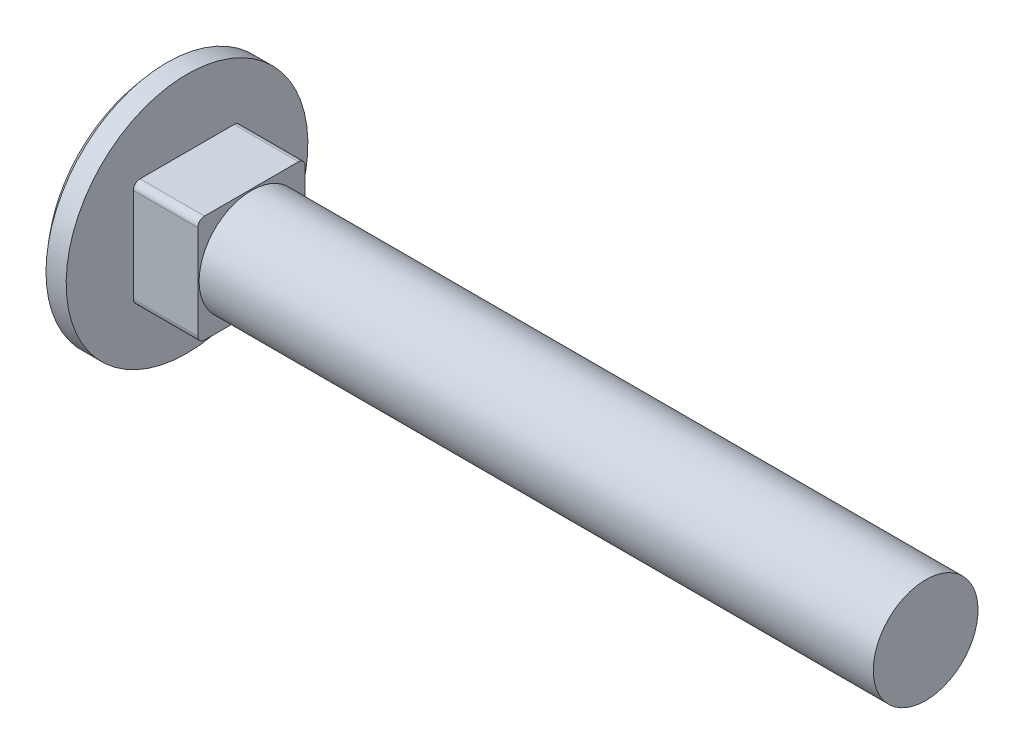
ISO-10303-21;
HEADER;
FILE_DESCRIPTION(('STEP AP214'),'2;1');
FILE_NAME('part.step','',(''),(''),'','','');
FILE_SCHEMA(('AUTOMOTIVE_DESIGN { 1 0 10303 214 1 1 1 1 }'));
ENDSEC;
DATA;
#1=APPLICATION_CONTEXT('core data for automotive mechanical design processes');
#2=APPLICATION_PROTOCOL_DEFINITION('international standard','automotive_design',2000,#1);
#3=PRODUCT_CONTEXT('',#1,'mechanical');
#4=PRODUCT('Part','Part','',(#3));
#5=PRODUCT_RELATED_PRODUCT_CATEGORY('part','',(#4));
#6=PRODUCT_DEFINITION_FORMATION('','',#4);
#7=PRODUCT_DEFINITION_CONTEXT('part definition',#1,'design');
#8=PRODUCT_DEFINITION('design','',#6,#7);
#9=PRODUCT_DEFINITION_SHAPE('','',#8);
#10=(LENGTH_UNIT() NAMED_UNIT(*) SI_UNIT(.MILLI.,.METRE.));
#11=(NAMED_UNIT(*) PLANE_ANGLE_UNIT() SI_UNIT($,.RADIAN.));
#12=(NAMED_UNIT(*) SI_UNIT($,.STERADIAN.) SOLID_ANGLE_UNIT());
#13=UNCERTAINTY_MEASURE_WITH_UNIT(LENGTH_MEASURE(1.E-05),#10,'distance_accuracy_value','');
#14=(GEOMETRIC_REPRESENTATION_CONTEXT(3) GLOBAL_UNCERTAINTY_ASSIGNED_CONTEXT((#13)) GLOBAL_UNIT_ASSIGNED_CONTEXT((#10,
#11,#12)) REPRESENTATION_CONTEXT('',''));
#15=CARTESIAN_POINT('',(0.,0.,0.));
#16=DIRECTION('',(0.,0.,1.));
#17=DIRECTION('',(1.,0.,0.));
#18=AXIS2_PLACEMENT_3D('',#15,#16,#17);
#19=CARTESIAN_POINT('',(779.702466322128,1095.70735678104,0.));
#20=DIRECTION('',(-1.,0.,0.));
#21=DIRECTION('',(0.,-1.,0.));
#22=AXIS2_PLACEMENT_3D('',#19,#20,#21);
#23=PLANE('',#22);
#24=CARTESIAN_POINT('',(779.702466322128,1091.80735678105,0.));
#25=DIRECTION('',(-1.,0.,0.));
#26=DIRECTION('',(0.,-1.,0.));
#27=AXIS2_PLACEMENT_3D('',#24,#25,#26);
#28=CIRCLE('',#27,9.00000000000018);
#29=CARTESIAN_POINT('',(779.702466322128,1082.80735678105,0.));
#30=VERTEX_POINT('',#29);
#31=EDGE_CURVE('E25',#30,#30,#28,.T.);
#32=ORIENTED_EDGE('',*,*,#31,.F.);
#33=EDGE_LOOP('',(#32));
#34=FACE_BOUND('',#33,.T.);
#35=CARTESIAN_POINT('',(779.702466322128,1095.30735678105,-3.5));
#36=DIRECTION('',(1.,0.,0.));
#37=DIRECTION('',(0.,1.,0.));
#38=AXIS2_PLACEMENT_3D('',#35,#36,#37);
#39=CIRCLE('',#38,0.499999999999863);
#40=CARTESIAN_POINT('',(779.702466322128,1095.30735678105,-4.));
#41=VERTEX_POINT('',#40);
#42=CARTESIAN_POINT('',(779.702466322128,1095.80735678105,-3.5));
#43=VERTEX_POINT('',#42);
#44=EDGE_CURVE('E78',#41,#43,#39,.T.);
#45=ORIENTED_EDGE('',*,*,#44,.F.);
#46=DIRECTION('',(0.,1.,0.));
#47=VECTOR('',#46,1.);
#48=CARTESIAN_POINT('',(779.702466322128,1088.30735678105,-4.));
#49=LINE('',#48,#47);
#50=CARTESIAN_POINT('',(779.702466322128,1088.30735678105,-4.));
#51=VERTEX_POINT('',#50);
#52=EDGE_CURVE('E80',#51,#41,#49,.T.);
#53=ORIENTED_EDGE('',*,*,#52,.F.);
#54=CARTESIAN_POINT('',(779.702466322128,1088.30735678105,-3.5));
#55=DIRECTION('',(1.,0.,0.));
#56=DIRECTION('',(0.,1.,0.));
#57=AXIS2_PLACEMENT_3D('',#54,#55,#56);
#58=CIRCLE('',#57,0.499999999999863);
#59=CARTESIAN_POINT('',(779.702466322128,1087.80735678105,-3.5));
#60=VERTEX_POINT('',#59);
#61=EDGE_CURVE('E96',#60,#51,#58,.T.);
#62=ORIENTED_EDGE('',*,*,#61,.F.);
#63=DIRECTION('',(0.,0.,-1.));
#64=VECTOR('',#63,1.);
#65=CARTESIAN_POINT('',(779.702466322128,1087.80735678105,-3.5));
#66=LINE('',#65,#64);
#67=CARTESIAN_POINT('',(779.702466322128,1087.80735678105,3.5));
#68=VERTEX_POINT('',#67);
#69=EDGE_CURVE('E212',#68,#60,#66,.T.);
#70=ORIENTED_EDGE('',*,*,#69,.F.);
#71=CARTESIAN_POINT('',(779.702466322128,1088.30735678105,3.5));
#72=DIRECTION('',(1.,0.,0.));
#73=DIRECTION('',(0.,1.,0.));
#74=AXIS2_PLACEMENT_3D('',#71,#72,#73);
#75=CIRCLE('',#74,0.499999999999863);
#76=CARTESIAN_POINT('',(779.702466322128,1088.30735678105,3.99999999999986));
#77=VERTEX_POINT('',#76);
#78=EDGE_CURVE('E214',#77,#68,#75,.T.);
#79=ORIENTED_EDGE('',*,*,#78,.F.);
#80=DIRECTION('',(0.,-1.,0.));
#81=VECTOR('',#80,1.);
#82=CARTESIAN_POINT('',(779.702466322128,1088.30735678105,4.));
#83=LINE('',#82,#81);
#84=CARTESIAN_POINT('',(779.702466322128,1095.30735678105,4.));
#85=VERTEX_POINT('',#84);
#86=EDGE_CURVE('E219',#85,#77,#83,.T.);
#87=ORIENTED_EDGE('',*,*,#86,.F.);
#88=CARTESIAN_POINT('',(779.702466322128,1095.30735678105,3.5));
#89=DIRECTION('',(1.,0.,0.));
#90=DIRECTION('',(0.,-1.,0.));
#91=AXIS2_PLACEMENT_3D('',#88,#89,#90);
#92=CIRCLE('',#91,0.499999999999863);
#93=CARTESIAN_POINT('',(779.702466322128,1095.80735678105,3.5));
#94=VERTEX_POINT('',#93);
#95=EDGE_CURVE('E37',#94,#85,#92,.T.);
#96=ORIENTED_EDGE('',*,*,#95,.F.);
#97=DIRECTION('',(0.,0.,1.));
#98=VECTOR('',#97,1.);
#99=CARTESIAN_POINT('',(779.702466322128,1095.80735678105,-3.5));
#100=LINE('',#99,#98);
#101=EDGE_CURVE('E32',#43,#94,#100,.T.);
#102=ORIENTED_EDGE('',*,*,#101,.F.);
#103=EDGE_LOOP('',(#45,#53,#62,#70,#79,#87,#96,#102));
#104=FACE_BOUND('',#103,.T.);
#105=ADVANCED_FACE('F16',(#34,#104),#23,.F.);
#106=CARTESIAN_POINT('',(766.18111762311,1091.80735678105,0.));
#107=DIRECTION('',(-1.,0.,0.));
#108=DIRECTION('',(0.,-1.,0.));
#109=AXIS2_PLACEMENT_3D('',#106,#107,#108);
#110=CYLINDRICAL_SURFACE('',#109,9.00000000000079);
#111=CARTESIAN_POINT('',(778.202466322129,1091.80735678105,0.));
#112=DIRECTION('',(-1.,0.,0.));
#113=DIRECTION('',(0.,-1.,0.));
#114=AXIS2_PLACEMENT_3D('',#111,#112,#113);
#115=CIRCLE('',#114,9.00000000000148);
#116=CARTESIAN_POINT('',(778.202466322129,1082.80735678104,0.));
#117=VERTEX_POINT('',#116);
#118=EDGE_CURVE('E124',#117,#117,#115,.T.);
#119=ORIENTED_EDGE('',*,*,#118,.F.);
#120=EDGE_LOOP('',(#119));
#121=FACE_BOUND('',#120,.T.);
#122=ORIENTED_EDGE('',*,*,#31,.T.);
#123=EDGE_LOOP('',(#122));
#124=FACE_BOUND('',#123,.T.);
#125=ADVANCED_FACE('F130',(#121,#124),#110,.T.);
#126=CARTESIAN_POINT('',(788.023894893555,1091.80735678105,0.));
#127=DIRECTION('',(-1.,0.,0.));
#128=DIRECTION('',(0.,1.,0.));
#129=AXIS2_PLACEMENT_3D('',#126,#127,#128);
#130=SPHERICAL_SURFACE('',#129,13.3214285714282);
#131=ORIENTED_EDGE('',*,*,#118,.T.);
#132=EDGE_LOOP('',(#131));
#133=FACE_BOUND('',#132,.T.);
#134=ADVANCED_FACE('F138',(#133),#130,.T.);
#135=CARTESIAN_POINT('',(784.502466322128,1095.30735678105,-3.5));
#136=DIRECTION('',(1.,0.,0.));
#137=DIRECTION('',(0.,1.,0.));
#138=AXIS2_PLACEMENT_3D('',#135,#136,#137);
#139=PLANE('',#138);
#140=CARTESIAN_POINT('',(784.502466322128,1095.30735678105,-3.5));
#141=DIRECTION('',(1.,0.,0.));
#142=DIRECTION('',(0.,1.,0.));
#143=AXIS2_PLACEMENT_3D('',#140,#141,#142);
#144=CIRCLE('',#143,0.499999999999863);
#145=CARTESIAN_POINT('',(784.502466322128,1095.30735678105,-4.));
#146=VERTEX_POINT('',#145);
#147=CARTESIAN_POINT('',(784.502466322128,1095.80735678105,-3.5));
#148=VERTEX_POINT('',#147);
#149=EDGE_CURVE('E95',#146,#148,#144,.T.);
#150=ORIENTED_EDGE('',*,*,#149,.T.);
#151=DIRECTION('',(0.,0.,1.));
#152=VECTOR('',#151,1.);
#153=CARTESIAN_POINT('',(784.502466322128,1095.80735678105,-3.5));
#154=LINE('',#153,#152);
#155=CARTESIAN_POINT('',(784.502466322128,1095.80735678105,3.5));
#156=VERTEX_POINT('',#155);
#157=EDGE_CURVE('E199',#148,#156,#154,.T.);
#158=ORIENTED_EDGE('',*,*,#157,.T.);
#159=CARTESIAN_POINT('',(784.502466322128,1095.30735678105,3.5));
#160=DIRECTION('',(1.,0.,0.));
#161=DIRECTION('',(0.,-1.,0.));
#162=AXIS2_PLACEMENT_3D('',#159,#160,#161);
#163=CIRCLE('',#162,0.499999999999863);
#164=CARTESIAN_POINT('',(784.502466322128,1095.30735678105,4.));
#165=VERTEX_POINT('',#164);
#166=EDGE_CURVE('E196',#156,#165,#163,.T.);
#167=ORIENTED_EDGE('',*,*,#166,.T.);
#168=DIRECTION('',(0.,-1.,0.));
#169=VECTOR('',#168,1.);
#170=CARTESIAN_POINT('',(784.502466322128,1088.30735678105,4.));
#171=LINE('',#170,#169);
#172=CARTESIAN_POINT('',(784.502466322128,1088.30735678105,3.99999999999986));
#173=VERTEX_POINT('',#172);
#174=EDGE_CURVE('E198',#165,#173,#171,.T.);
#175=ORIENTED_EDGE('',*,*,#174,.T.);
#176=CARTESIAN_POINT('',(784.502466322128,1088.30735678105,3.5));
#177=DIRECTION('',(1.,0.,0.));
#178=DIRECTION('',(0.,1.,0.));
#179=AXIS2_PLACEMENT_3D('',#176,#177,#178);
#180=CIRCLE('',#179,0.499999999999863);
#181=CARTESIAN_POINT('',(784.502466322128,1087.80735678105,3.5));
#182=VERTEX_POINT('',#181);
#183=EDGE_CURVE('E201',#173,#182,#180,.T.);
#184=ORIENTED_EDGE('',*,*,#183,.T.);
#185=DIRECTION('',(0.,0.,-1.));
#186=VECTOR('',#185,1.);
#187=CARTESIAN_POINT('',(784.502466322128,1087.80735678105,-3.5));
#188=LINE('',#187,#186);
#189=CARTESIAN_POINT('',(784.502466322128,1087.80735678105,-3.5));
#190=VERTEX_POINT('',#189);
#191=EDGE_CURVE('E207',#182,#190,#188,.T.);
#192=ORIENTED_EDGE('',*,*,#191,.T.);
#193=CARTESIAN_POINT('',(784.502466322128,1088.30735678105,-3.5));
#194=DIRECTION('',(1.,0.,0.));
#195=DIRECTION('',(0.,1.,0.));
#196=AXIS2_PLACEMENT_3D('',#193,#194,#195);
#197=CIRCLE('',#196,0.499999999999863);
#198=CARTESIAN_POINT('',(784.502466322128,1088.30735678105,-4.));
#199=VERTEX_POINT('',#198);
#200=EDGE_CURVE('E104',#190,#199,#197,.T.);
#201=ORIENTED_EDGE('',*,*,#200,.T.);
#202=DIRECTION('',(0.,1.,0.));
#203=VECTOR('',#202,1.);
#204=CARTESIAN_POINT('',(784.502466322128,1088.30735678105,-4.));
#205=LINE('',#204,#203);
#206=EDGE_CURVE('E100',#199,#146,#205,.T.);
#207=ORIENTED_EDGE('',*,*,#206,.T.);
#208=EDGE_LOOP('',(#150,#158,#167,#175,#184,#192,#201,#207));
#209=FACE_BOUND('',#208,.T.);
#210=CARTESIAN_POINT('',(784.502466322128,1091.80735678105,0.));
#211=DIRECTION('',(1.,0.,0.));
#212=DIRECTION('',(0.,1.,0.));
#213=AXIS2_PLACEMENT_3D('',#210,#211,#212);
#214=CIRCLE('',#213,3.89999999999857);
#215=CARTESIAN_POINT('',(784.502466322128,1095.70735678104,0.));
#216=VERTEX_POINT('',#215);
#217=EDGE_CURVE('E20',#216,#216,#214,.T.);
#218=ORIENTED_EDGE('',*,*,#217,.F.);
#219=EDGE_LOOP('',(#218));
#220=FACE_BOUND('',#219,.T.);
#221=ADVANCED_FACE('F154',(#209,#220),#139,.T.);
#222=CARTESIAN_POINT('',(784.502466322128,1095.30735678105,-3.5));
#223=DIRECTION('',(-1.,0.,0.));
#224=DIRECTION('',(0.,-1.,0.));
#225=AXIS2_PLACEMENT_3D('',#222,#223,#224);
#226=CYLINDRICAL_SURFACE('',#225,0.499999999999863);
#227=ORIENTED_EDGE('',*,*,#44,.T.);
#228=DIRECTION('',(-1.,0.,0.));
#229=VECTOR('',#228,1.);
#230=CARTESIAN_POINT('',(784.502466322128,1095.80735678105,-3.5));
#231=LINE('',#230,#229);
#232=EDGE_CURVE('E122',#148,#43,#231,.T.);
#233=ORIENTED_EDGE('',*,*,#232,.F.);
#234=ORIENTED_EDGE('',*,*,#149,.F.);
#235=DIRECTION('',(-1.,0.,0.));
#236=VECTOR('',#235,1.);
#237=CARTESIAN_POINT('',(784.502466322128,1095.30735678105,-4.));
#238=LINE('',#237,#236);
#239=EDGE_CURVE('E91',#146,#41,#238,.T.);
#240=ORIENTED_EDGE('',*,*,#239,.T.);
#241=EDGE_LOOP('',(#227,#233,#234,#240));
#242=FACE_BOUND('',#241,.T.);
#243=ADVANCED_FACE('F98',(#242),#226,.T.);
#244=CARTESIAN_POINT('',(784.502466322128,1095.80735678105,-3.5));
#245=DIRECTION('',(0.,-1.,0.));
#246=DIRECTION('',(1.,0.,0.));
#247=AXIS2_PLACEMENT_3D('',#244,#245,#246);
#248=PLANE('',#247);
#249=ORIENTED_EDGE('',*,*,#101,.T.);
#250=DIRECTION('',(-1.,0.,0.));
#251=VECTOR('',#250,1.);
#252=CARTESIAN_POINT('',(784.502466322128,1095.80735678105,3.5));
#253=LINE('',#252,#251);
#254=EDGE_CURVE('E119',#156,#94,#253,.T.);
#255=ORIENTED_EDGE('',*,*,#254,.F.);
#256=ORIENTED_EDGE('',*,*,#157,.F.);
#257=ORIENTED_EDGE('',*,*,#232,.T.);
#258=EDGE_LOOP('',(#249,#255,#256,#257));
#259=FACE_BOUND('',#258,.T.);
#260=ADVANCED_FACE('F162',(#259),#248,.F.);
#261=CARTESIAN_POINT('',(784.502466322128,1095.30735678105,3.5));
#262=DIRECTION('',(-1.,0.,0.));
#263=DIRECTION('',(0.,-1.,0.));
#264=AXIS2_PLACEMENT_3D('',#261,#262,#263);
#265=CYLINDRICAL_SURFACE('',#264,0.499999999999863);
#266=ORIENTED_EDGE('',*,*,#95,.T.);
#267=DIRECTION('',(-1.,0.,0.));
#268=VECTOR('',#267,1.);
#269=CARTESIAN_POINT('',(784.502466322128,1095.30735678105,4.));
#270=LINE('',#269,#268);
#271=EDGE_CURVE('E116',#165,#85,#270,.T.);
#272=ORIENTED_EDGE('',*,*,#271,.F.);
#273=ORIENTED_EDGE('',*,*,#166,.F.);
#274=ORIENTED_EDGE('',*,*,#254,.T.);
#275=EDGE_LOOP('',(#266,#272,#273,#274));
#276=FACE_BOUND('',#275,.T.);
#277=ADVANCED_FACE('F183',(#276),#265,.T.);
#278=CARTESIAN_POINT('',(784.502466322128,1088.30735678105,4.));
#279=DIRECTION('',(0.,0.,-1.));
#280=DIRECTION('',(0.,1.,0.));
#281=AXIS2_PLACEMENT_3D('',#278,#279,#280);
#282=PLANE('',#281);
#283=ORIENTED_EDGE('',*,*,#86,.T.);
#284=DIRECTION('',(-1.,0.,0.));
#285=VECTOR('',#284,1.);
#286=CARTESIAN_POINT('',(784.502466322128,1088.30735678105,3.99999999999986));
#287=LINE('',#286,#285);
#288=EDGE_CURVE('E113',#173,#77,#287,.T.);
#289=ORIENTED_EDGE('',*,*,#288,.F.);
#290=ORIENTED_EDGE('',*,*,#174,.F.);
#291=ORIENTED_EDGE('',*,*,#271,.T.);
#292=EDGE_LOOP('',(#283,#289,#290,#291));
#293=FACE_BOUND('',#292,.T.);
#294=ADVANCED_FACE('F179',(#293),#282,.F.);
#295=CARTESIAN_POINT('',(784.502466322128,1088.30735678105,3.5));
#296=DIRECTION('',(-1.,0.,0.));
#297=DIRECTION('',(0.,-1.,0.));
#298=AXIS2_PLACEMENT_3D('',#295,#296,#297);
#299=CYLINDRICAL_SURFACE('',#298,0.499999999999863);
#300=ORIENTED_EDGE('',*,*,#78,.T.);
#301=DIRECTION('',(-1.,0.,0.));
#302=VECTOR('',#301,1.);
#303=CARTESIAN_POINT('',(784.502466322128,1087.80735678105,3.5));
#304=LINE('',#303,#302);
#305=EDGE_CURVE('E110',#182,#68,#304,.T.);
#306=ORIENTED_EDGE('',*,*,#305,.F.);
#307=ORIENTED_EDGE('',*,*,#183,.F.);
#308=ORIENTED_EDGE('',*,*,#288,.T.);
#309=EDGE_LOOP('',(#300,#306,#307,#308));
#310=FACE_BOUND('',#309,.T.);
#311=ADVANCED_FACE('F175',(#310),#299,.T.);
#312=CARTESIAN_POINT('',(784.502466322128,1087.80735678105,-3.5));
#313=DIRECTION('',(0.,1.,0.));
#314=DIRECTION('',(-1.,0.,0.));
#315=AXIS2_PLACEMENT_3D('',#312,#313,#314);
#316=PLANE('',#315);
#317=ORIENTED_EDGE('',*,*,#69,.T.);
#318=DIRECTION('',(-1.,0.,0.));
#319=VECTOR('',#318,1.);
#320=CARTESIAN_POINT('',(784.502466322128,1087.80735678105,-3.5));
#321=LINE('',#320,#319);
#322=EDGE_CURVE('E102',#190,#60,#321,.T.);
#323=ORIENTED_EDGE('',*,*,#322,.F.);
#324=ORIENTED_EDGE('',*,*,#191,.F.);
#325=ORIENTED_EDGE('',*,*,#305,.T.);
#326=EDGE_LOOP('',(#317,#323,#324,#325));
#327=FACE_BOUND('',#326,.T.);
#328=ADVANCED_FACE('F171',(#327),#316,.F.);
#329=CARTESIAN_POINT('',(784.502466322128,1088.30735678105,-3.5));
#330=DIRECTION('',(-1.,0.,0.));
#331=DIRECTION('',(0.,-1.,0.));
#332=AXIS2_PLACEMENT_3D('',#329,#330,#331);
#333=CYLINDRICAL_SURFACE('',#332,0.499999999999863);
#334=ORIENTED_EDGE('',*,*,#61,.T.);
#335=DIRECTION('',(-1.,0.,0.));
#336=VECTOR('',#335,1.);
#337=CARTESIAN_POINT('',(784.502466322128,1088.30735678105,-4.));
#338=LINE('',#337,#336);
#339=EDGE_CURVE('E94',#199,#51,#338,.T.);
#340=ORIENTED_EDGE('',*,*,#339,.F.);
#341=ORIENTED_EDGE('',*,*,#200,.F.);
#342=ORIENTED_EDGE('',*,*,#322,.T.);
#343=EDGE_LOOP('',(#334,#340,#341,#342));
#344=FACE_BOUND('',#343,.T.);
#345=ADVANCED_FACE('F168',(#344),#333,.T.);
#346=CARTESIAN_POINT('',(784.502466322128,1088.30735678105,-4.));
#347=DIRECTION('',(0.,0.,1.));
#348=DIRECTION('',(0.,-1.,0.));
#349=AXIS2_PLACEMENT_3D('',#346,#347,#348);
#350=PLANE('',#349);
#351=ORIENTED_EDGE('',*,*,#52,.T.);
#352=ORIENTED_EDGE('',*,*,#239,.F.);
#353=ORIENTED_EDGE('',*,*,#206,.F.);
#354=ORIENTED_EDGE('',*,*,#339,.T.);
#355=EDGE_LOOP('',(#351,#352,#353,#354));
#356=FACE_BOUND('',#355,.T.);
#357=ADVANCED_FACE('F89',(#356),#350,.F.);
#358=CARTESIAN_POINT('',(834.702466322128,1095.70735678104,0.));
#359=DIRECTION('',(-1.,0.,0.));
#360=DIRECTION('',(0.,-1.,0.));
#361=AXIS2_PLACEMENT_3D('',#358,#359,#360);
#362=PLANE('',#361);
#363=CARTESIAN_POINT('',(834.702466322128,1091.80735678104,0.));
#364=DIRECTION('',(-1.,0.,0.));
#365=DIRECTION('',(0.,-1.,0.));
#366=AXIS2_PLACEMENT_3D('',#363,#364,#365);
#367=CIRCLE('',#366,3.89999999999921);
#368=CARTESIAN_POINT('',(834.702466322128,1087.90735678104,0.));
#369=VERTEX_POINT('',#368);
#370=EDGE_CURVE('E11',#369,#369,#367,.T.);
#371=ORIENTED_EDGE('',*,*,#370,.F.);
#372=EDGE_LOOP('',(#371));
#373=FACE_BOUND('',#372,.T.);
#374=ADVANCED_FACE('F18',(#373),#362,.F.);
#375=CARTESIAN_POINT('',(766.18111762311,1091.80735678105,0.));
#376=DIRECTION('',(-1.,0.,0.));
#377=DIRECTION('',(0.,-1.,0.));
#378=AXIS2_PLACEMENT_3D('',#375,#376,#377);
#379=CYLINDRICAL_SURFACE('',#378,3.89999999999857);
#380=ORIENTED_EDGE('',*,*,#217,.T.);
#381=EDGE_LOOP('',(#380));
#382=FACE_BOUND('',#381,.T.);
#383=ORIENTED_EDGE('',*,*,#370,.T.);
#384=EDGE_LOOP('',(#383));
#385=FACE_BOUND('',#384,.T.);
#386=ADVANCED_FACE('F142',(#382,#385),#379,.T.);
#387=CLOSED_SHELL('',(#105,#125,#134,#221,#243,#260,#277,#294,#311,#328,#345,#357,#374,#386));
#388=MANIFOLD_SOLID_BREP('B1',#387);
#389=ADVANCED_BREP_SHAPE_REPRESENTATION('',(#18,#388),#14);
#390=SHAPE_DEFINITION_REPRESENTATION(#9,#389);
ENDSEC;
END-ISO-10303-21;
